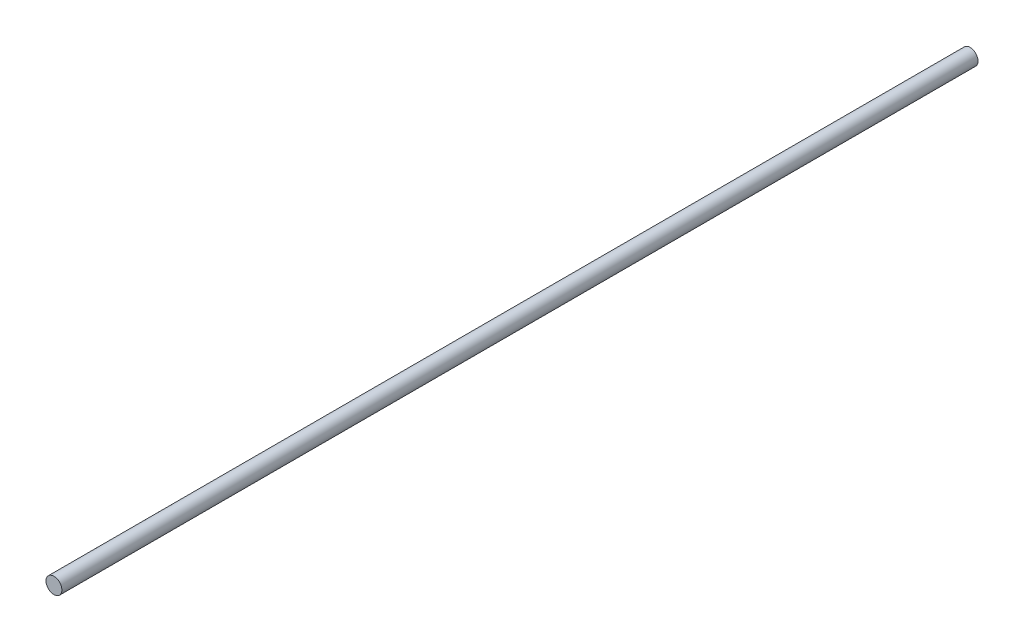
from build123d import *

# Parameters (mm, degrees)
SKETCH1_R           = 3.96875
BOSS_EXTRUDE1_DEPTH = 457.2


with BuildPart() as part:
    # Sketch1 → Boss-Extrude1 (new body)
    with BuildSketch(Plane.XY):
        Circle(SKETCH1_R)
    extrude(amount=BOSS_EXTRUDE1_DEPTH)


solid = part.part
